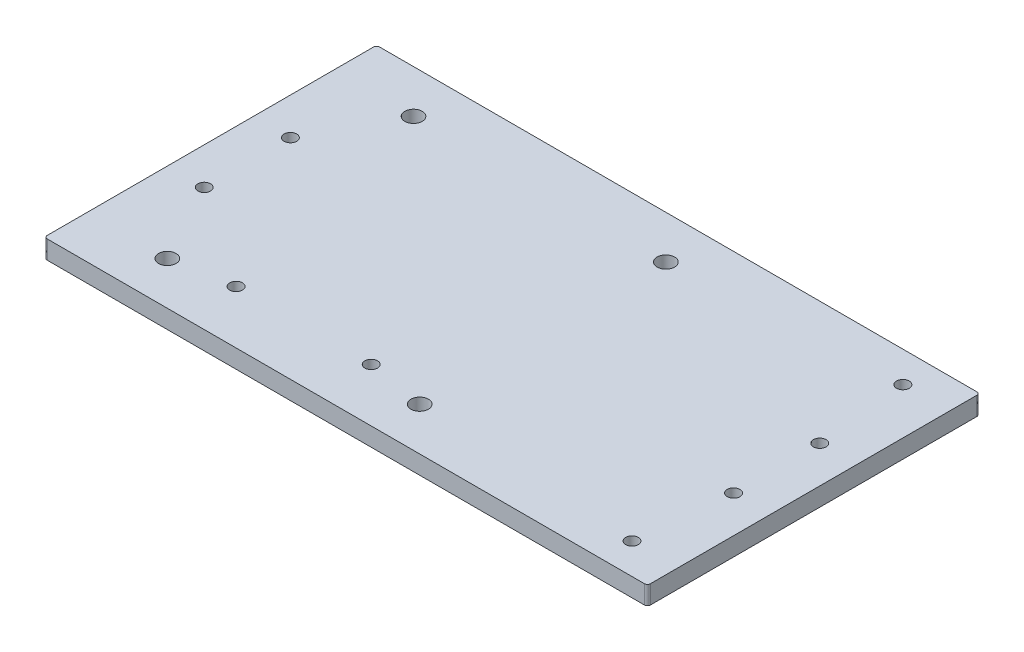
from build123d import *

# Parameters (mm, degrees)
SKETCH1_W           = 98
SKETCH1_H           = 54
BOSS_EXTRUDE1_DEPTH = 3
SKETCH2_R           = 1.03
CUT_EXTRUDE1_DEPTH  = 3
SKETCH3_R           = 1.42
CUT_EXTRUDE2_DEPTH  = 57.026779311
SKETCH4_R           = 1.03
CUT_EXTRUDE3_DEPTH  = 57.026779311
SKETCH5_R           = 1.03
CUT_EXTRUDE5_DEPTH  = 10
FILLET1_R           = 0.5


with BuildPart() as part:
    # Sketch1 → Boss-Extrude1 (new body)
    with BuildSketch(Plane(origin=(0, 0, 0), x_dir=(1, 0, 0), z_dir=(0, 1, 0))):
        Rectangle(SKETCH1_W, SKETCH1_H)
    extrude(amount=BOSS_EXTRUDE1_DEPTH)

    # Sketch2 → Cut-Extrude1 (cut)
    with BuildSketch(Plane(origin=(0, 3, 0), x_dir=(1, 0, 0), z_dir=(0, 1, 0))):
        with Locations(Location((41.5, 22, 0), (0, 0, 270))):
            Circle(SKETCH2_R)
        with Locations(Location((41.5, -22, 0), (0, 0, 90))):
            Circle(SKETCH2_R)
    extrude(amount=-CUT_EXTRUDE1_DEPTH, mode=Mode.SUBTRACT)

    # Sketch3 → Cut-Extrude2 (cut, through all)
    with BuildSketch(Plane(origin=(0, 3, 0), x_dir=(1, 0, 0), z_dir=(0, 1, 0))):
        with Locations(Location((5, -20, 0), (0, 0, 270))):
            Circle(SKETCH3_R)
        with Locations(Location((-36, -20, 0), (0, 0, 270))):
            Circle(SKETCH3_R)
        with Locations(Location((5, 20, 0), (0, 0, 90))):
            Circle(SKETCH3_R)
        with Locations(Location((-36, 20, 0), (0, 0, 90))):
            Circle(SKETCH3_R)
    extrude(amount=-CUT_EXTRUDE2_DEPTH, mode=Mode.SUBTRACT)

    # Sketch4 → Cut-Extrude3 (cut, through all)
    with BuildSketch(Plane(origin=(0, 3, 0), x_dir=(1, 0, 0), z_dir=(0, 1, 0))):
        with Locations(Location((-4.525, -18.35, 0), (0, 0, 270))):
            Circle(SKETCH4_R)
        with Locations(Location((-26.475, -18.35, 0), (0, 0, 90))):
            Circle(SKETCH4_R)
    extrude(amount=-CUT_EXTRUDE3_DEPTH, mode=Mode.SUBTRACT)

    # Sketch5 → Cut-Extrude5 (cut)
    with BuildSketch(Plane(origin=(0, 3, 0), x_dir=(1, 0, 0), z_dir=(0, 1, 0))):
        with Locations(Location((-43, 7, 0), (0, 0, 270))):
            Circle(SKETCH5_R)
        with Locations(Location((43, 7, 0), (0, 0, 270))):
            Circle(SKETCH5_R)
        with Locations(Location((43, -7, 0), (0, 0, 270))):
            Circle(SKETCH5_R)
        with Locations(Location((-43, -7, 0), (0, 0, 270))):
            Circle(SKETCH5_R)
    extrude(amount=-CUT_EXTRUDE5_DEPTH, mode=Mode.SUBTRACT)

    # Fillet1
    fillet1_edges = [part.edges().sort_by_distance(p)[0] for p in [
        (49, 1.5, 27),
        (-49, 1.5, 27),
        (-49, 1.5, -27),
        (49, 1.5, -27),
    ]]
    fillet(fillet1_edges, radius=FILLET1_R)


solid = part.part
